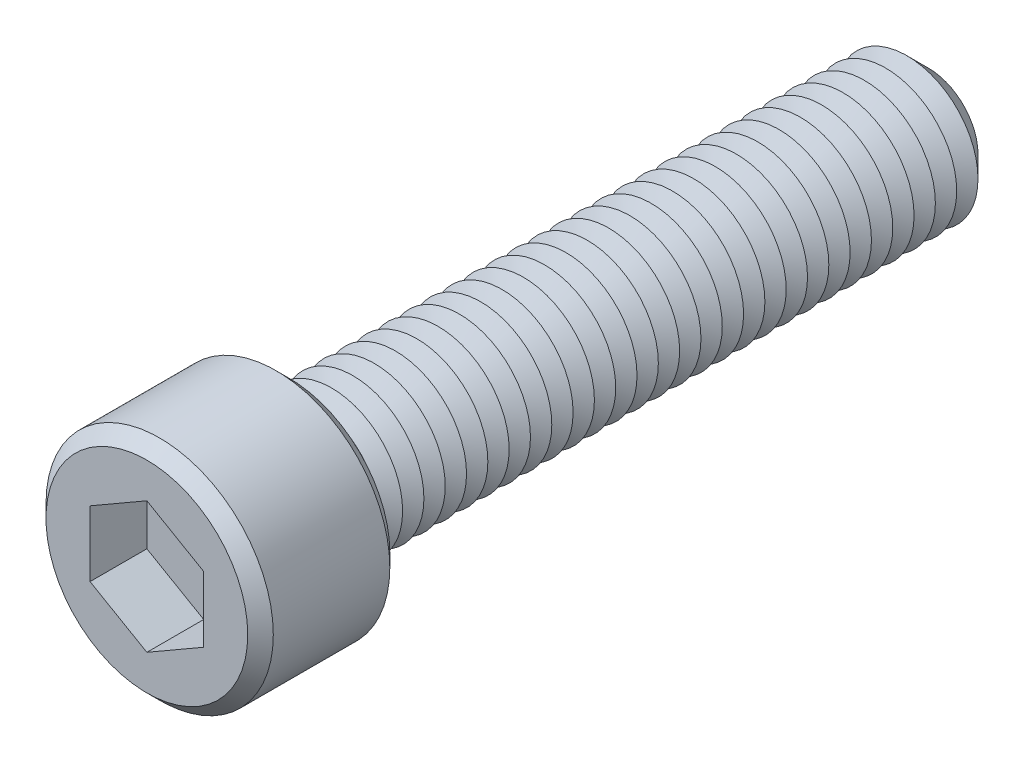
ISO-10303-21;
HEADER;
FILE_DESCRIPTION(('STEP AP214'),'2;1');
FILE_NAME('part.step','',(''),(''),'','','');
FILE_SCHEMA(('AUTOMOTIVE_DESIGN { 1 0 10303 214 1 1 1 1 }'));
ENDSEC;
DATA;
#1=APPLICATION_CONTEXT('core data for automotive mechanical design processes');
#2=APPLICATION_PROTOCOL_DEFINITION('international standard','automotive_design',2000,#1);
#3=PRODUCT_CONTEXT('',#1,'mechanical');
#4=PRODUCT('Part','Part','',(#3));
#5=PRODUCT_RELATED_PRODUCT_CATEGORY('part','',(#4));
#6=PRODUCT_DEFINITION_FORMATION('','',#4);
#7=PRODUCT_DEFINITION_CONTEXT('part definition',#1,'design');
#8=PRODUCT_DEFINITION('design','',#6,#7);
#9=PRODUCT_DEFINITION_SHAPE('','',#8);
#10=(LENGTH_UNIT() NAMED_UNIT(*) SI_UNIT(.MILLI.,.METRE.));
#11=(NAMED_UNIT(*) PLANE_ANGLE_UNIT() SI_UNIT($,.RADIAN.));
#12=(NAMED_UNIT(*) SI_UNIT($,.STERADIAN.) SOLID_ANGLE_UNIT());
#13=UNCERTAINTY_MEASURE_WITH_UNIT(LENGTH_MEASURE(1.E-05),#10,'distance_accuracy_value','');
#14=(GEOMETRIC_REPRESENTATION_CONTEXT(3) GLOBAL_UNCERTAINTY_ASSIGNED_CONTEXT((#13)) GLOBAL_UNIT_ASSIGNED_CONTEXT((#10,
#11,#12)) REPRESENTATION_CONTEXT('',''));
#15=CARTESIAN_POINT('',(0.,0.,0.));
#16=DIRECTION('',(0.,0.,1.));
#17=DIRECTION('',(1.,0.,0.));
#18=AXIS2_PLACEMENT_3D('',#15,#16,#17);
#19=CARTESIAN_POINT('',(0.,0.,10.));
#20=DIRECTION('',(0.,0.,-1.));
#21=DIRECTION('',(-1.,0.,0.));
#22=AXIS2_PLACEMENT_3D('',#19,#20,#21);
#23=CYLINDRICAL_SURFACE('',#22,8.);
#24=CARTESIAN_POINT('',(0.,0.,0.899999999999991));
#25=DIRECTION('',(0.,0.,1.));
#26=DIRECTION('',(1.,0.,0.));
#27=AXIS2_PLACEMENT_3D('',#24,#25,#26);
#28=CIRCLE('',#27,8.);
#29=CARTESIAN_POINT('',(8.,0.,0.899999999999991));
#30=VERTEX_POINT('',#29);
#31=EDGE_CURVE('E408',#30,#30,#28,.T.);
#32=ORIENTED_EDGE('',*,*,#31,.T.);
#33=EDGE_LOOP('',(#32));
#34=FACE_BOUND('',#33,.T.);
#35=CARTESIAN_POINT('',(0.,0.,9.09999999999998));
#36=DIRECTION('',(0.,0.,1.));
#37=DIRECTION('',(1.,0.,0.));
#38=AXIS2_PLACEMENT_3D('',#35,#36,#37);
#39=CIRCLE('',#38,8.);
#40=CARTESIAN_POINT('',(8.,0.,9.09999999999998));
#41=VERTEX_POINT('',#40);
#42=EDGE_CURVE('E404',#41,#41,#39,.F.);
#43=ORIENTED_EDGE('',*,*,#42,.T.);
#44=EDGE_LOOP('',(#43));
#45=FACE_BOUND('',#44,.T.);
#46=ADVANCED_FACE('F39',(#34,#45),#23,.T.);
#47=CARTESIAN_POINT('',(0.,0.,10.));
#48=DIRECTION('',(0.,0.,1.));
#49=DIRECTION('',(1.,0.,0.));
#50=AXIS2_PLACEMENT_3D('',#47,#48,#49);
#51=PLANE('',#50);
#52=CARTESIAN_POINT('',(0.,0.,10.));
#53=DIRECTION('',(0.,0.,1.));
#54=DIRECTION('',(1.,0.,0.));
#55=AXIS2_PLACEMENT_3D('',#52,#53,#54);
#56=CIRCLE('',#55,7.09999999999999);
#57=CARTESIAN_POINT('',(7.09999999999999,0.,10.));
#58=VERTEX_POINT('',#57);
#59=EDGE_CURVE('E11',#58,#58,#56,.T.);
#60=ORIENTED_EDGE('',*,*,#59,.T.);
#61=EDGE_LOOP('',(#60));
#62=FACE_BOUND('',#61,.T.);
#63=DIRECTION('',(-0.866025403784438,0.5,0.));
#64=VECTOR('',#63,1.);
#65=CARTESIAN_POINT('',(4.,2.3094010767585,10.));
#66=LINE('',#65,#64);
#67=CARTESIAN_POINT('',(4.,2.3094010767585,10.));
#68=VERTEX_POINT('',#67);
#69=CARTESIAN_POINT('',(0.,4.61880215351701,10.));
#70=VERTEX_POINT('',#69);
#71=EDGE_CURVE('E55',#68,#70,#66,.T.);
#72=ORIENTED_EDGE('',*,*,#71,.F.);
#73=DIRECTION('',(0.,1.,0.));
#74=VECTOR('',#73,1.);
#75=CARTESIAN_POINT('',(4.,-2.30940107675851,10.));
#76=LINE('',#75,#74);
#77=CARTESIAN_POINT('',(4.,-2.30940107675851,10.));
#78=VERTEX_POINT('',#77);
#79=EDGE_CURVE('E150',#78,#68,#76,.T.);
#80=ORIENTED_EDGE('',*,*,#79,.F.);
#81=DIRECTION('',(0.866025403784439,0.5,0.));
#82=VECTOR('',#81,1.);
#83=CARTESIAN_POINT('',(0.,-4.61880215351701,10.));
#84=LINE('',#83,#82);
#85=CARTESIAN_POINT('',(0.,-4.61880215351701,10.));
#86=VERTEX_POINT('',#85);
#87=EDGE_CURVE('E147',#86,#78,#84,.T.);
#88=ORIENTED_EDGE('',*,*,#87,.F.);
#89=DIRECTION('',(0.866025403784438,-0.5,0.));
#90=VECTOR('',#89,1.);
#91=CARTESIAN_POINT('',(-4.,-2.3094010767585,10.));
#92=LINE('',#91,#90);
#93=CARTESIAN_POINT('',(-4.,-2.3094010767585,10.));
#94=VERTEX_POINT('',#93);
#95=EDGE_CURVE('E103',#94,#86,#92,.T.);
#96=ORIENTED_EDGE('',*,*,#95,.F.);
#97=DIRECTION('',(0.,-1.,0.));
#98=VECTOR('',#97,1.);
#99=CARTESIAN_POINT('',(-4.,2.3094010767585,10.));
#100=LINE('',#99,#98);
#101=CARTESIAN_POINT('',(-4.,2.3094010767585,10.));
#102=VERTEX_POINT('',#101);
#103=EDGE_CURVE('E141',#102,#94,#100,.T.);
#104=ORIENTED_EDGE('',*,*,#103,.F.);
#105=DIRECTION('',(-0.866025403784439,-0.5,0.));
#106=VECTOR('',#105,1.);
#107=CARTESIAN_POINT('',(0.,4.61880215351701,10.));
#108=LINE('',#107,#106);
#109=EDGE_CURVE('E136',#70,#102,#108,.T.);
#110=ORIENTED_EDGE('',*,*,#109,.F.);
#111=EDGE_LOOP('',(#72,#80,#88,#96,#104,#110));
#112=FACE_BOUND('',#111,.T.);
#113=ADVANCED_FACE('F427',(#62,#112),#51,.T.);
#114=CARTESIAN_POINT('',(0.,0.,0.));
#115=DIRECTION('',(0.,0.,1.));
#116=DIRECTION('',(1.,0.,0.));
#117=AXIS2_PLACEMENT_3D('',#114,#115,#116);
#118=PLANE('',#117);
#119=CARTESIAN_POINT('',(0.,0.,0.));
#120=DIRECTION('',(0.,0.,1.));
#121=DIRECTION('',(1.,0.,0.));
#122=AXIS2_PLACEMENT_3D('',#119,#120,#121);
#123=CIRCLE('',#122,7.1);
#124=CARTESIAN_POINT('',(7.1,0.,0.));
#125=VERTEX_POINT('',#124);
#126=EDGE_CURVE('E48',#125,#125,#123,.F.);
#127=ORIENTED_EDGE('',*,*,#126,.T.);
#128=EDGE_LOOP('',(#127));
#129=FACE_BOUND('',#128,.T.);
#130=CARTESIAN_POINT('',(0.,0.,0.));
#131=DIRECTION('',(0.,0.,1.));
#132=DIRECTION('',(1.,0.,0.));
#133=AXIS2_PLACEMENT_3D('',#130,#131,#132);
#134=CIRCLE('',#133,5.);
#135=CARTESIAN_POINT('',(5.,0.,0.));
#136=VERTEX_POINT('',#135);
#137=EDGE_CURVE('E396',#136,#136,#134,.T.);
#138=ORIENTED_EDGE('',*,*,#137,.T.);
#139=EDGE_LOOP('',(#138));
#140=FACE_BOUND('',#139,.T.);
#141=ADVANCED_FACE('F416',(#129,#140),#118,.F.);
#142=CARTESIAN_POINT('',(0.,0.,0.));
#143=DIRECTION('',(0.,0.,1.));
#144=DIRECTION('',(1.,0.,0.));
#145=AXIS2_PLACEMENT_3D('',#142,#143,#144);
#146=CONICAL_SURFACE('',#145,5.,1.0471975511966);
#147=CARTESIAN_POINT('',(0.,0.,-0.75));
#148=DIRECTION('',(0.,0.,1.));
#149=DIRECTION('',(1.,0.,0.));
#150=AXIS2_PLACEMENT_3D('',#147,#148,#149);
#151=CIRCLE('',#150,3.70096189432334);
#152=CARTESIAN_POINT('',(3.70096189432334,0.,-0.75));
#153=VERTEX_POINT('',#152);
#154=EDGE_CURVE('E392',#153,#153,#151,.T.);
#155=ORIENTED_EDGE('',*,*,#154,.T.);
#156=EDGE_LOOP('',(#155));
#157=FACE_BOUND('',#156,.T.);
#158=ORIENTED_EDGE('',*,*,#137,.F.);
#159=EDGE_LOOP('',(#158));
#160=FACE_BOUND('',#159,.T.);
#161=ADVANCED_FACE('F708',(#157,#160),#146,.T.);
#162=CARTESIAN_POINT('',(0.,0.,-0.75));
#163=DIRECTION('',(0.,0.,-1.));
#164=DIRECTION('',(-1.,0.,0.));
#165=AXIS2_PLACEMENT_3D('',#162,#163,#164);
#166=CONICAL_SURFACE('',#165,3.70096189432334,1.0471975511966);
#167=CARTESIAN_POINT('',(0.,0.,-1.5));
#168=DIRECTION('',(0.,0.,1.));
#169=DIRECTION('',(1.,0.,0.));
#170=AXIS2_PLACEMENT_3D('',#167,#168,#169);
#171=CIRCLE('',#170,5.);
#172=CARTESIAN_POINT('',(5.,0.,-1.5));
#173=VERTEX_POINT('',#172);
#174=EDGE_CURVE('E388',#173,#173,#171,.T.);
#175=ORIENTED_EDGE('',*,*,#174,.T.);
#176=EDGE_LOOP('',(#175));
#177=FACE_BOUND('',#176,.T.);
#178=ORIENTED_EDGE('',*,*,#154,.F.);
#179=EDGE_LOOP('',(#178));
#180=FACE_BOUND('',#179,.T.);
#181=ADVANCED_FACE('F704',(#177,#180),#166,.T.);
#182=CARTESIAN_POINT('',(0.,0.,-1.5));
#183=DIRECTION('',(0.,0.,1.));
#184=DIRECTION('',(1.,0.,0.));
#185=AXIS2_PLACEMENT_3D('',#182,#183,#184);
#186=CONICAL_SURFACE('',#185,5.,1.0471975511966);
#187=CARTESIAN_POINT('',(0.,0.,-2.25));
#188=DIRECTION('',(0.,0.,1.));
#189=DIRECTION('',(1.,0.,0.));
#190=AXIS2_PLACEMENT_3D('',#187,#188,#189);
#191=CIRCLE('',#190,3.70096189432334);
#192=CARTESIAN_POINT('',(3.70096189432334,0.,-2.25));
#193=VERTEX_POINT('',#192);
#194=EDGE_CURVE('E384',#193,#193,#191,.T.);
#195=ORIENTED_EDGE('',*,*,#194,.T.);
#196=EDGE_LOOP('',(#195));
#197=FACE_BOUND('',#196,.T.);
#198=ORIENTED_EDGE('',*,*,#174,.F.);
#199=EDGE_LOOP('',(#198));
#200=FACE_BOUND('',#199,.T.);
#201=ADVANCED_FACE('F700',(#197,#200),#186,.T.);
#202=CARTESIAN_POINT('',(0.,0.,-2.25));
#203=DIRECTION('',(0.,0.,-1.));
#204=DIRECTION('',(-1.,0.,0.));
#205=AXIS2_PLACEMENT_3D('',#202,#203,#204);
#206=CONICAL_SURFACE('',#205,3.70096189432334,1.0471975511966);
#207=CARTESIAN_POINT('',(0.,0.,-3.));
#208=DIRECTION('',(0.,0.,1.));
#209=DIRECTION('',(1.,0.,0.));
#210=AXIS2_PLACEMENT_3D('',#207,#208,#209);
#211=CIRCLE('',#210,5.);
#212=CARTESIAN_POINT('',(5.,0.,-3.));
#213=VERTEX_POINT('',#212);
#214=EDGE_CURVE('E380',#213,#213,#211,.T.);
#215=ORIENTED_EDGE('',*,*,#214,.T.);
#216=EDGE_LOOP('',(#215));
#217=FACE_BOUND('',#216,.T.);
#218=ORIENTED_EDGE('',*,*,#194,.F.);
#219=EDGE_LOOP('',(#218));
#220=FACE_BOUND('',#219,.T.);
#221=ADVANCED_FACE('F696',(#217,#220),#206,.T.);
#222=CARTESIAN_POINT('',(0.,0.,-3.));
#223=DIRECTION('',(0.,0.,1.));
#224=DIRECTION('',(1.,0.,0.));
#225=AXIS2_PLACEMENT_3D('',#222,#223,#224);
#226=CONICAL_SURFACE('',#225,5.,1.0471975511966);
#227=CARTESIAN_POINT('',(0.,0.,-3.75));
#228=DIRECTION('',(0.,0.,1.));
#229=DIRECTION('',(1.,0.,0.));
#230=AXIS2_PLACEMENT_3D('',#227,#228,#229);
#231=CIRCLE('',#230,3.70096189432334);
#232=CARTESIAN_POINT('',(3.70096189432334,0.,-3.75));
#233=VERTEX_POINT('',#232);
#234=EDGE_CURVE('E376',#233,#233,#231,.T.);
#235=ORIENTED_EDGE('',*,*,#234,.T.);
#236=EDGE_LOOP('',(#235));
#237=FACE_BOUND('',#236,.T.);
#238=ORIENTED_EDGE('',*,*,#214,.F.);
#239=EDGE_LOOP('',(#238));
#240=FACE_BOUND('',#239,.T.);
#241=ADVANCED_FACE('F692',(#237,#240),#226,.T.);
#242=CARTESIAN_POINT('',(0.,0.,-3.75));
#243=DIRECTION('',(0.,0.,-1.));
#244=DIRECTION('',(-1.,0.,0.));
#245=AXIS2_PLACEMENT_3D('',#242,#243,#244);
#246=CONICAL_SURFACE('',#245,3.70096189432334,1.0471975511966);
#247=CARTESIAN_POINT('',(0.,0.,-4.5));
#248=DIRECTION('',(0.,0.,1.));
#249=DIRECTION('',(1.,0.,0.));
#250=AXIS2_PLACEMENT_3D('',#247,#248,#249);
#251=CIRCLE('',#250,5.);
#252=CARTESIAN_POINT('',(5.,0.,-4.5));
#253=VERTEX_POINT('',#252);
#254=EDGE_CURVE('E372',#253,#253,#251,.T.);
#255=ORIENTED_EDGE('',*,*,#254,.T.);
#256=EDGE_LOOP('',(#255));
#257=FACE_BOUND('',#256,.T.);
#258=ORIENTED_EDGE('',*,*,#234,.F.);
#259=EDGE_LOOP('',(#258));
#260=FACE_BOUND('',#259,.T.);
#261=ADVANCED_FACE('F688',(#257,#260),#246,.T.);
#262=CARTESIAN_POINT('',(0.,0.,-4.5));
#263=DIRECTION('',(0.,0.,1.));
#264=DIRECTION('',(1.,0.,0.));
#265=AXIS2_PLACEMENT_3D('',#262,#263,#264);
#266=CONICAL_SURFACE('',#265,5.,1.0471975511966);
#267=CARTESIAN_POINT('',(0.,0.,-5.25));
#268=DIRECTION('',(0.,0.,1.));
#269=DIRECTION('',(1.,0.,0.));
#270=AXIS2_PLACEMENT_3D('',#267,#268,#269);
#271=CIRCLE('',#270,3.70096189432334);
#272=CARTESIAN_POINT('',(3.70096189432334,0.,-5.25));
#273=VERTEX_POINT('',#272);
#274=EDGE_CURVE('E368',#273,#273,#271,.T.);
#275=ORIENTED_EDGE('',*,*,#274,.T.);
#276=EDGE_LOOP('',(#275));
#277=FACE_BOUND('',#276,.T.);
#278=ORIENTED_EDGE('',*,*,#254,.F.);
#279=EDGE_LOOP('',(#278));
#280=FACE_BOUND('',#279,.T.);
#281=ADVANCED_FACE('F684',(#277,#280),#266,.T.);
#282=CARTESIAN_POINT('',(0.,0.,-5.25));
#283=DIRECTION('',(0.,0.,-1.));
#284=DIRECTION('',(-1.,0.,0.));
#285=AXIS2_PLACEMENT_3D('',#282,#283,#284);
#286=CONICAL_SURFACE('',#285,3.70096189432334,1.0471975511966);
#287=CARTESIAN_POINT('',(0.,0.,-6.));
#288=DIRECTION('',(0.,0.,1.));
#289=DIRECTION('',(1.,0.,0.));
#290=AXIS2_PLACEMENT_3D('',#287,#288,#289);
#291=CIRCLE('',#290,5.);
#292=CARTESIAN_POINT('',(5.,0.,-6.));
#293=VERTEX_POINT('',#292);
#294=EDGE_CURVE('E364',#293,#293,#291,.T.);
#295=ORIENTED_EDGE('',*,*,#294,.T.);
#296=EDGE_LOOP('',(#295));
#297=FACE_BOUND('',#296,.T.);
#298=ORIENTED_EDGE('',*,*,#274,.F.);
#299=EDGE_LOOP('',(#298));
#300=FACE_BOUND('',#299,.T.);
#301=ADVANCED_FACE('F680',(#297,#300),#286,.T.);
#302=CARTESIAN_POINT('',(0.,0.,-6.));
#303=DIRECTION('',(0.,0.,1.));
#304=DIRECTION('',(1.,0.,0.));
#305=AXIS2_PLACEMENT_3D('',#302,#303,#304);
#306=CONICAL_SURFACE('',#305,5.,1.0471975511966);
#307=CARTESIAN_POINT('',(0.,0.,-6.75));
#308=DIRECTION('',(0.,0.,1.));
#309=DIRECTION('',(1.,0.,0.));
#310=AXIS2_PLACEMENT_3D('',#307,#308,#309);
#311=CIRCLE('',#310,3.70096189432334);
#312=CARTESIAN_POINT('',(3.70096189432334,0.,-6.75));
#313=VERTEX_POINT('',#312);
#314=EDGE_CURVE('E360',#313,#313,#311,.T.);
#315=ORIENTED_EDGE('',*,*,#314,.T.);
#316=EDGE_LOOP('',(#315));
#317=FACE_BOUND('',#316,.T.);
#318=ORIENTED_EDGE('',*,*,#294,.F.);
#319=EDGE_LOOP('',(#318));
#320=FACE_BOUND('',#319,.T.);
#321=ADVANCED_FACE('F676',(#317,#320),#306,.T.);
#322=CARTESIAN_POINT('',(0.,0.,-6.75));
#323=DIRECTION('',(0.,0.,-1.));
#324=DIRECTION('',(-1.,0.,0.));
#325=AXIS2_PLACEMENT_3D('',#322,#323,#324);
#326=CONICAL_SURFACE('',#325,3.70096189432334,1.0471975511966);
#327=CARTESIAN_POINT('',(0.,0.,-7.5));
#328=DIRECTION('',(0.,0.,1.));
#329=DIRECTION('',(1.,0.,0.));
#330=AXIS2_PLACEMENT_3D('',#327,#328,#329);
#331=CIRCLE('',#330,5.);
#332=CARTESIAN_POINT('',(5.,0.,-7.5));
#333=VERTEX_POINT('',#332);
#334=EDGE_CURVE('E356',#333,#333,#331,.T.);
#335=ORIENTED_EDGE('',*,*,#334,.T.);
#336=EDGE_LOOP('',(#335));
#337=FACE_BOUND('',#336,.T.);
#338=ORIENTED_EDGE('',*,*,#314,.F.);
#339=EDGE_LOOP('',(#338));
#340=FACE_BOUND('',#339,.T.);
#341=ADVANCED_FACE('F672',(#337,#340),#326,.T.);
#342=CARTESIAN_POINT('',(0.,0.,-7.5));
#343=DIRECTION('',(0.,0.,1.));
#344=DIRECTION('',(1.,0.,0.));
#345=AXIS2_PLACEMENT_3D('',#342,#343,#344);
#346=CONICAL_SURFACE('',#345,5.,1.0471975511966);
#347=CARTESIAN_POINT('',(0.,0.,-8.25));
#348=DIRECTION('',(0.,0.,1.));
#349=DIRECTION('',(1.,0.,0.));
#350=AXIS2_PLACEMENT_3D('',#347,#348,#349);
#351=CIRCLE('',#350,3.70096189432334);
#352=CARTESIAN_POINT('',(3.70096189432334,0.,-8.25));
#353=VERTEX_POINT('',#352);
#354=EDGE_CURVE('E352',#353,#353,#351,.T.);
#355=ORIENTED_EDGE('',*,*,#354,.T.);
#356=EDGE_LOOP('',(#355));
#357=FACE_BOUND('',#356,.T.);
#358=ORIENTED_EDGE('',*,*,#334,.F.);
#359=EDGE_LOOP('',(#358));
#360=FACE_BOUND('',#359,.T.);
#361=ADVANCED_FACE('F668',(#357,#360),#346,.T.);
#362=CARTESIAN_POINT('',(0.,0.,-8.25));
#363=DIRECTION('',(0.,0.,-1.));
#364=DIRECTION('',(-1.,0.,0.));
#365=AXIS2_PLACEMENT_3D('',#362,#363,#364);
#366=CONICAL_SURFACE('',#365,3.70096189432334,1.0471975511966);
#367=CARTESIAN_POINT('',(0.,0.,-9.));
#368=DIRECTION('',(0.,0.,1.));
#369=DIRECTION('',(1.,0.,0.));
#370=AXIS2_PLACEMENT_3D('',#367,#368,#369);
#371=CIRCLE('',#370,5.);
#372=CARTESIAN_POINT('',(5.,0.,-9.));
#373=VERTEX_POINT('',#372);
#374=EDGE_CURVE('E348',#373,#373,#371,.T.);
#375=ORIENTED_EDGE('',*,*,#374,.T.);
#376=EDGE_LOOP('',(#375));
#377=FACE_BOUND('',#376,.T.);
#378=ORIENTED_EDGE('',*,*,#354,.F.);
#379=EDGE_LOOP('',(#378));
#380=FACE_BOUND('',#379,.T.);
#381=ADVANCED_FACE('F664',(#377,#380),#366,.T.);
#382=CARTESIAN_POINT('',(0.,0.,-9.));
#383=DIRECTION('',(0.,0.,1.));
#384=DIRECTION('',(1.,0.,0.));
#385=AXIS2_PLACEMENT_3D('',#382,#383,#384);
#386=CONICAL_SURFACE('',#385,5.,1.0471975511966);
#387=CARTESIAN_POINT('',(0.,0.,-9.75));
#388=DIRECTION('',(0.,0.,1.));
#389=DIRECTION('',(1.,0.,0.));
#390=AXIS2_PLACEMENT_3D('',#387,#388,#389);
#391=CIRCLE('',#390,3.70096189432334);
#392=CARTESIAN_POINT('',(3.70096189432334,0.,-9.75));
#393=VERTEX_POINT('',#392);
#394=EDGE_CURVE('E344',#393,#393,#391,.T.);
#395=ORIENTED_EDGE('',*,*,#394,.T.);
#396=EDGE_LOOP('',(#395));
#397=FACE_BOUND('',#396,.T.);
#398=ORIENTED_EDGE('',*,*,#374,.F.);
#399=EDGE_LOOP('',(#398));
#400=FACE_BOUND('',#399,.T.);
#401=ADVANCED_FACE('F660',(#397,#400),#386,.T.);
#402=CARTESIAN_POINT('',(0.,0.,-9.75));
#403=DIRECTION('',(0.,0.,-1.));
#404=DIRECTION('',(-1.,0.,0.));
#405=AXIS2_PLACEMENT_3D('',#402,#403,#404);
#406=CONICAL_SURFACE('',#405,3.70096189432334,1.0471975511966);
#407=CARTESIAN_POINT('',(0.,0.,-10.5));
#408=DIRECTION('',(0.,0.,1.));
#409=DIRECTION('',(1.,0.,0.));
#410=AXIS2_PLACEMENT_3D('',#407,#408,#409);
#411=CIRCLE('',#410,5.);
#412=CARTESIAN_POINT('',(5.,0.,-10.5));
#413=VERTEX_POINT('',#412);
#414=EDGE_CURVE('E340',#413,#413,#411,.T.);
#415=ORIENTED_EDGE('',*,*,#414,.T.);
#416=EDGE_LOOP('',(#415));
#417=FACE_BOUND('',#416,.T.);
#418=ORIENTED_EDGE('',*,*,#394,.F.);
#419=EDGE_LOOP('',(#418));
#420=FACE_BOUND('',#419,.T.);
#421=ADVANCED_FACE('F656',(#417,#420),#406,.T.);
#422=CARTESIAN_POINT('',(0.,0.,-10.5));
#423=DIRECTION('',(0.,0.,1.));
#424=DIRECTION('',(1.,0.,0.));
#425=AXIS2_PLACEMENT_3D('',#422,#423,#424);
#426=CONICAL_SURFACE('',#425,5.,1.0471975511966);
#427=CARTESIAN_POINT('',(0.,0.,-11.25));
#428=DIRECTION('',(0.,0.,1.));
#429=DIRECTION('',(1.,0.,0.));
#430=AXIS2_PLACEMENT_3D('',#427,#428,#429);
#431=CIRCLE('',#430,3.70096189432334);
#432=CARTESIAN_POINT('',(3.70096189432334,0.,-11.25));
#433=VERTEX_POINT('',#432);
#434=EDGE_CURVE('E336',#433,#433,#431,.T.);
#435=ORIENTED_EDGE('',*,*,#434,.T.);
#436=EDGE_LOOP('',(#435));
#437=FACE_BOUND('',#436,.T.);
#438=ORIENTED_EDGE('',*,*,#414,.F.);
#439=EDGE_LOOP('',(#438));
#440=FACE_BOUND('',#439,.T.);
#441=ADVANCED_FACE('F652',(#437,#440),#426,.T.);
#442=CARTESIAN_POINT('',(0.,0.,-11.25));
#443=DIRECTION('',(0.,0.,-1.));
#444=DIRECTION('',(-1.,0.,0.));
#445=AXIS2_PLACEMENT_3D('',#442,#443,#444);
#446=CONICAL_SURFACE('',#445,3.70096189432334,1.0471975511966);
#447=CARTESIAN_POINT('',(0.,0.,-12.));
#448=DIRECTION('',(0.,0.,1.));
#449=DIRECTION('',(1.,0.,0.));
#450=AXIS2_PLACEMENT_3D('',#447,#448,#449);
#451=CIRCLE('',#450,5.);
#452=CARTESIAN_POINT('',(5.,0.,-12.));
#453=VERTEX_POINT('',#452);
#454=EDGE_CURVE('E332',#453,#453,#451,.T.);
#455=ORIENTED_EDGE('',*,*,#454,.T.);
#456=EDGE_LOOP('',(#455));
#457=FACE_BOUND('',#456,.T.);
#458=ORIENTED_EDGE('',*,*,#434,.F.);
#459=EDGE_LOOP('',(#458));
#460=FACE_BOUND('',#459,.T.);
#461=ADVANCED_FACE('F648',(#457,#460),#446,.T.);
#462=CARTESIAN_POINT('',(0.,0.,-12.));
#463=DIRECTION('',(0.,0.,1.));
#464=DIRECTION('',(1.,0.,0.));
#465=AXIS2_PLACEMENT_3D('',#462,#463,#464);
#466=CONICAL_SURFACE('',#465,5.,1.0471975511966);
#467=CARTESIAN_POINT('',(0.,0.,-12.75));
#468=DIRECTION('',(0.,0.,1.));
#469=DIRECTION('',(1.,0.,0.));
#470=AXIS2_PLACEMENT_3D('',#467,#468,#469);
#471=CIRCLE('',#470,3.70096189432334);
#472=CARTESIAN_POINT('',(3.70096189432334,0.,-12.75));
#473=VERTEX_POINT('',#472);
#474=EDGE_CURVE('E328',#473,#473,#471,.T.);
#475=ORIENTED_EDGE('',*,*,#474,.T.);
#476=EDGE_LOOP('',(#475));
#477=FACE_BOUND('',#476,.T.);
#478=ORIENTED_EDGE('',*,*,#454,.F.);
#479=EDGE_LOOP('',(#478));
#480=FACE_BOUND('',#479,.T.);
#481=ADVANCED_FACE('F644',(#477,#480),#466,.T.);
#482=CARTESIAN_POINT('',(0.,0.,-12.75));
#483=DIRECTION('',(0.,0.,-1.));
#484=DIRECTION('',(-1.,0.,0.));
#485=AXIS2_PLACEMENT_3D('',#482,#483,#484);
#486=CONICAL_SURFACE('',#485,3.70096189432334,1.0471975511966);
#487=CARTESIAN_POINT('',(0.,0.,-13.5));
#488=DIRECTION('',(0.,0.,1.));
#489=DIRECTION('',(1.,0.,0.));
#490=AXIS2_PLACEMENT_3D('',#487,#488,#489);
#491=CIRCLE('',#490,5.);
#492=CARTESIAN_POINT('',(5.,0.,-13.5));
#493=VERTEX_POINT('',#492);
#494=EDGE_CURVE('E324',#493,#493,#491,.T.);
#495=ORIENTED_EDGE('',*,*,#494,.T.);
#496=EDGE_LOOP('',(#495));
#497=FACE_BOUND('',#496,.T.);
#498=ORIENTED_EDGE('',*,*,#474,.F.);
#499=EDGE_LOOP('',(#498));
#500=FACE_BOUND('',#499,.T.);
#501=ADVANCED_FACE('F640',(#497,#500),#486,.T.);
#502=CARTESIAN_POINT('',(0.,0.,-13.5));
#503=DIRECTION('',(0.,0.,1.));
#504=DIRECTION('',(1.,0.,0.));
#505=AXIS2_PLACEMENT_3D('',#502,#503,#504);
#506=CONICAL_SURFACE('',#505,5.,1.0471975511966);
#507=CARTESIAN_POINT('',(0.,0.,-14.25));
#508=DIRECTION('',(0.,0.,1.));
#509=DIRECTION('',(1.,0.,0.));
#510=AXIS2_PLACEMENT_3D('',#507,#508,#509);
#511=CIRCLE('',#510,3.70096189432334);
#512=CARTESIAN_POINT('',(3.70096189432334,0.,-14.25));
#513=VERTEX_POINT('',#512);
#514=EDGE_CURVE('E320',#513,#513,#511,.T.);
#515=ORIENTED_EDGE('',*,*,#514,.T.);
#516=EDGE_LOOP('',(#515));
#517=FACE_BOUND('',#516,.T.);
#518=ORIENTED_EDGE('',*,*,#494,.F.);
#519=EDGE_LOOP('',(#518));
#520=FACE_BOUND('',#519,.T.);
#521=ADVANCED_FACE('F636',(#517,#520),#506,.T.);
#522=CARTESIAN_POINT('',(0.,0.,-14.25));
#523=DIRECTION('',(0.,0.,-1.));
#524=DIRECTION('',(-1.,0.,0.));
#525=AXIS2_PLACEMENT_3D('',#522,#523,#524);
#526=CONICAL_SURFACE('',#525,3.70096189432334,1.0471975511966);
#527=CARTESIAN_POINT('',(0.,0.,-15.));
#528=DIRECTION('',(0.,0.,1.));
#529=DIRECTION('',(1.,0.,0.));
#530=AXIS2_PLACEMENT_3D('',#527,#528,#529);
#531=CIRCLE('',#530,5.);
#532=CARTESIAN_POINT('',(5.,0.,-15.));
#533=VERTEX_POINT('',#532);
#534=EDGE_CURVE('E316',#533,#533,#531,.T.);
#535=ORIENTED_EDGE('',*,*,#534,.T.);
#536=EDGE_LOOP('',(#535));
#537=FACE_BOUND('',#536,.T.);
#538=ORIENTED_EDGE('',*,*,#514,.F.);
#539=EDGE_LOOP('',(#538));
#540=FACE_BOUND('',#539,.T.);
#541=ADVANCED_FACE('F632',(#537,#540),#526,.T.);
#542=CARTESIAN_POINT('',(0.,0.,-15.));
#543=DIRECTION('',(0.,0.,1.));
#544=DIRECTION('',(1.,0.,0.));
#545=AXIS2_PLACEMENT_3D('',#542,#543,#544);
#546=CONICAL_SURFACE('',#545,5.,1.0471975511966);
#547=CARTESIAN_POINT('',(0.,0.,-15.75));
#548=DIRECTION('',(0.,0.,1.));
#549=DIRECTION('',(1.,0.,0.));
#550=AXIS2_PLACEMENT_3D('',#547,#548,#549);
#551=CIRCLE('',#550,3.70096189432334);
#552=CARTESIAN_POINT('',(3.70096189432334,0.,-15.75));
#553=VERTEX_POINT('',#552);
#554=EDGE_CURVE('E312',#553,#553,#551,.T.);
#555=ORIENTED_EDGE('',*,*,#554,.T.);
#556=EDGE_LOOP('',(#555));
#557=FACE_BOUND('',#556,.T.);
#558=ORIENTED_EDGE('',*,*,#534,.F.);
#559=EDGE_LOOP('',(#558));
#560=FACE_BOUND('',#559,.T.);
#561=ADVANCED_FACE('F628',(#557,#560),#546,.T.);
#562=CARTESIAN_POINT('',(0.,0.,-15.75));
#563=DIRECTION('',(0.,0.,-1.));
#564=DIRECTION('',(-1.,0.,0.));
#565=AXIS2_PLACEMENT_3D('',#562,#563,#564);
#566=CONICAL_SURFACE('',#565,3.70096189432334,1.0471975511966);
#567=CARTESIAN_POINT('',(0.,0.,-16.5));
#568=DIRECTION('',(0.,0.,1.));
#569=DIRECTION('',(1.,0.,0.));
#570=AXIS2_PLACEMENT_3D('',#567,#568,#569);
#571=CIRCLE('',#570,5.);
#572=CARTESIAN_POINT('',(5.,0.,-16.5));
#573=VERTEX_POINT('',#572);
#574=EDGE_CURVE('E308',#573,#573,#571,.T.);
#575=ORIENTED_EDGE('',*,*,#574,.T.);
#576=EDGE_LOOP('',(#575));
#577=FACE_BOUND('',#576,.T.);
#578=ORIENTED_EDGE('',*,*,#554,.F.);
#579=EDGE_LOOP('',(#578));
#580=FACE_BOUND('',#579,.T.);
#581=ADVANCED_FACE('F624',(#577,#580),#566,.T.);
#582=CARTESIAN_POINT('',(0.,0.,-16.5));
#583=DIRECTION('',(0.,0.,1.));
#584=DIRECTION('',(1.,0.,0.));
#585=AXIS2_PLACEMENT_3D('',#582,#583,#584);
#586=CONICAL_SURFACE('',#585,5.,1.0471975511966);
#587=CARTESIAN_POINT('',(0.,0.,-17.25));
#588=DIRECTION('',(0.,0.,1.));
#589=DIRECTION('',(1.,0.,0.));
#590=AXIS2_PLACEMENT_3D('',#587,#588,#589);
#591=CIRCLE('',#590,3.70096189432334);
#592=CARTESIAN_POINT('',(3.70096189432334,0.,-17.25));
#593=VERTEX_POINT('',#592);
#594=EDGE_CURVE('E304',#593,#593,#591,.T.);
#595=ORIENTED_EDGE('',*,*,#594,.T.);
#596=EDGE_LOOP('',(#595));
#597=FACE_BOUND('',#596,.T.);
#598=ORIENTED_EDGE('',*,*,#574,.F.);
#599=EDGE_LOOP('',(#598));
#600=FACE_BOUND('',#599,.T.);
#601=ADVANCED_FACE('F620',(#597,#600),#586,.T.);
#602=CARTESIAN_POINT('',(0.,0.,-17.25));
#603=DIRECTION('',(0.,0.,-1.));
#604=DIRECTION('',(-1.,0.,0.));
#605=AXIS2_PLACEMENT_3D('',#602,#603,#604);
#606=CONICAL_SURFACE('',#605,3.70096189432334,1.0471975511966);
#607=CARTESIAN_POINT('',(0.,0.,-18.));
#608=DIRECTION('',(0.,0.,1.));
#609=DIRECTION('',(1.,0.,0.));
#610=AXIS2_PLACEMENT_3D('',#607,#608,#609);
#611=CIRCLE('',#610,5.);
#612=CARTESIAN_POINT('',(5.,0.,-18.));
#613=VERTEX_POINT('',#612);
#614=EDGE_CURVE('E300',#613,#613,#611,.T.);
#615=ORIENTED_EDGE('',*,*,#614,.T.);
#616=EDGE_LOOP('',(#615));
#617=FACE_BOUND('',#616,.T.);
#618=ORIENTED_EDGE('',*,*,#594,.F.);
#619=EDGE_LOOP('',(#618));
#620=FACE_BOUND('',#619,.T.);
#621=ADVANCED_FACE('F616',(#617,#620),#606,.T.);
#622=CARTESIAN_POINT('',(0.,0.,-18.));
#623=DIRECTION('',(0.,0.,1.));
#624=DIRECTION('',(1.,0.,0.));
#625=AXIS2_PLACEMENT_3D('',#622,#623,#624);
#626=CONICAL_SURFACE('',#625,5.,1.0471975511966);
#627=CARTESIAN_POINT('',(0.,0.,-18.75));
#628=DIRECTION('',(0.,0.,1.));
#629=DIRECTION('',(1.,0.,0.));
#630=AXIS2_PLACEMENT_3D('',#627,#628,#629);
#631=CIRCLE('',#630,3.70096189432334);
#632=CARTESIAN_POINT('',(3.70096189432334,0.,-18.75));
#633=VERTEX_POINT('',#632);
#634=EDGE_CURVE('E296',#633,#633,#631,.T.);
#635=ORIENTED_EDGE('',*,*,#634,.T.);
#636=EDGE_LOOP('',(#635));
#637=FACE_BOUND('',#636,.T.);
#638=ORIENTED_EDGE('',*,*,#614,.F.);
#639=EDGE_LOOP('',(#638));
#640=FACE_BOUND('',#639,.T.);
#641=ADVANCED_FACE('F612',(#637,#640),#626,.T.);
#642=CARTESIAN_POINT('',(0.,0.,-18.75));
#643=DIRECTION('',(0.,0.,-1.));
#644=DIRECTION('',(-1.,0.,0.));
#645=AXIS2_PLACEMENT_3D('',#642,#643,#644);
#646=CONICAL_SURFACE('',#645,3.70096189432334,1.0471975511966);
#647=CARTESIAN_POINT('',(0.,0.,-19.5));
#648=DIRECTION('',(0.,0.,1.));
#649=DIRECTION('',(1.,0.,0.));
#650=AXIS2_PLACEMENT_3D('',#647,#648,#649);
#651=CIRCLE('',#650,5.);
#652=CARTESIAN_POINT('',(5.,0.,-19.5));
#653=VERTEX_POINT('',#652);
#654=EDGE_CURVE('E292',#653,#653,#651,.T.);
#655=ORIENTED_EDGE('',*,*,#654,.T.);
#656=EDGE_LOOP('',(#655));
#657=FACE_BOUND('',#656,.T.);
#658=ORIENTED_EDGE('',*,*,#634,.F.);
#659=EDGE_LOOP('',(#658));
#660=FACE_BOUND('',#659,.T.);
#661=ADVANCED_FACE('F608',(#657,#660),#646,.T.);
#662=CARTESIAN_POINT('',(0.,0.,-19.5));
#663=DIRECTION('',(0.,0.,1.));
#664=DIRECTION('',(1.,0.,0.));
#665=AXIS2_PLACEMENT_3D('',#662,#663,#664);
#666=CONICAL_SURFACE('',#665,5.,1.0471975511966);
#667=CARTESIAN_POINT('',(0.,0.,-20.25));
#668=DIRECTION('',(0.,0.,1.));
#669=DIRECTION('',(1.,0.,0.));
#670=AXIS2_PLACEMENT_3D('',#667,#668,#669);
#671=CIRCLE('',#670,3.70096189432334);
#672=CARTESIAN_POINT('',(3.70096189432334,0.,-20.25));
#673=VERTEX_POINT('',#672);
#674=EDGE_CURVE('E288',#673,#673,#671,.T.);
#675=ORIENTED_EDGE('',*,*,#674,.T.);
#676=EDGE_LOOP('',(#675));
#677=FACE_BOUND('',#676,.T.);
#678=ORIENTED_EDGE('',*,*,#654,.F.);
#679=EDGE_LOOP('',(#678));
#680=FACE_BOUND('',#679,.T.);
#681=ADVANCED_FACE('F604',(#677,#680),#666,.T.);
#682=CARTESIAN_POINT('',(0.,0.,-20.25));
#683=DIRECTION('',(0.,0.,-1.));
#684=DIRECTION('',(-1.,0.,0.));
#685=AXIS2_PLACEMENT_3D('',#682,#683,#684);
#686=CONICAL_SURFACE('',#685,3.70096189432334,1.0471975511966);
#687=CARTESIAN_POINT('',(0.,0.,-21.));
#688=DIRECTION('',(0.,0.,1.));
#689=DIRECTION('',(1.,0.,0.));
#690=AXIS2_PLACEMENT_3D('',#687,#688,#689);
#691=CIRCLE('',#690,5.);
#692=CARTESIAN_POINT('',(5.,0.,-21.));
#693=VERTEX_POINT('',#692);
#694=EDGE_CURVE('E284',#693,#693,#691,.T.);
#695=ORIENTED_EDGE('',*,*,#694,.T.);
#696=EDGE_LOOP('',(#695));
#697=FACE_BOUND('',#696,.T.);
#698=ORIENTED_EDGE('',*,*,#674,.F.);
#699=EDGE_LOOP('',(#698));
#700=FACE_BOUND('',#699,.T.);
#701=ADVANCED_FACE('F600',(#697,#700),#686,.T.);
#702=CARTESIAN_POINT('',(0.,0.,-21.));
#703=DIRECTION('',(0.,0.,1.));
#704=DIRECTION('',(1.,0.,0.));
#705=AXIS2_PLACEMENT_3D('',#702,#703,#704);
#706=CONICAL_SURFACE('',#705,5.,1.0471975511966);
#707=CARTESIAN_POINT('',(0.,0.,-21.75));
#708=DIRECTION('',(0.,0.,1.));
#709=DIRECTION('',(1.,0.,0.));
#710=AXIS2_PLACEMENT_3D('',#707,#708,#709);
#711=CIRCLE('',#710,3.70096189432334);
#712=CARTESIAN_POINT('',(3.70096189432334,0.,-21.75));
#713=VERTEX_POINT('',#712);
#714=EDGE_CURVE('E280',#713,#713,#711,.T.);
#715=ORIENTED_EDGE('',*,*,#714,.T.);
#716=EDGE_LOOP('',(#715));
#717=FACE_BOUND('',#716,.T.);
#718=ORIENTED_EDGE('',*,*,#694,.F.);
#719=EDGE_LOOP('',(#718));
#720=FACE_BOUND('',#719,.T.);
#721=ADVANCED_FACE('F596',(#717,#720),#706,.T.);
#722=CARTESIAN_POINT('',(0.,0.,-21.75));
#723=DIRECTION('',(0.,0.,-1.));
#724=DIRECTION('',(-1.,0.,0.));
#725=AXIS2_PLACEMENT_3D('',#722,#723,#724);
#726=CONICAL_SURFACE('',#725,3.70096189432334,1.0471975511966);
#727=CARTESIAN_POINT('',(0.,0.,-22.5));
#728=DIRECTION('',(0.,0.,1.));
#729=DIRECTION('',(1.,0.,0.));
#730=AXIS2_PLACEMENT_3D('',#727,#728,#729);
#731=CIRCLE('',#730,5.);
#732=CARTESIAN_POINT('',(5.,0.,-22.5));
#733=VERTEX_POINT('',#732);
#734=EDGE_CURVE('E276',#733,#733,#731,.T.);
#735=ORIENTED_EDGE('',*,*,#734,.T.);
#736=EDGE_LOOP('',(#735));
#737=FACE_BOUND('',#736,.T.);
#738=ORIENTED_EDGE('',*,*,#714,.F.);
#739=EDGE_LOOP('',(#738));
#740=FACE_BOUND('',#739,.T.);
#741=ADVANCED_FACE('F592',(#737,#740),#726,.T.);
#742=CARTESIAN_POINT('',(0.,0.,-22.5));
#743=DIRECTION('',(0.,0.,1.));
#744=DIRECTION('',(1.,0.,0.));
#745=AXIS2_PLACEMENT_3D('',#742,#743,#744);
#746=CONICAL_SURFACE('',#745,5.,1.0471975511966);
#747=CARTESIAN_POINT('',(0.,0.,-23.25));
#748=DIRECTION('',(0.,0.,1.));
#749=DIRECTION('',(1.,0.,0.));
#750=AXIS2_PLACEMENT_3D('',#747,#748,#749);
#751=CIRCLE('',#750,3.70096189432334);
#752=CARTESIAN_POINT('',(3.70096189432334,0.,-23.25));
#753=VERTEX_POINT('',#752);
#754=EDGE_CURVE('E272',#753,#753,#751,.T.);
#755=ORIENTED_EDGE('',*,*,#754,.T.);
#756=EDGE_LOOP('',(#755));
#757=FACE_BOUND('',#756,.T.);
#758=ORIENTED_EDGE('',*,*,#734,.F.);
#759=EDGE_LOOP('',(#758));
#760=FACE_BOUND('',#759,.T.);
#761=ADVANCED_FACE('F588',(#757,#760),#746,.T.);
#762=CARTESIAN_POINT('',(0.,0.,-23.25));
#763=DIRECTION('',(0.,0.,-1.));
#764=DIRECTION('',(-1.,0.,0.));
#765=AXIS2_PLACEMENT_3D('',#762,#763,#764);
#766=CONICAL_SURFACE('',#765,3.70096189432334,1.0471975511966);
#767=CARTESIAN_POINT('',(0.,0.,-24.));
#768=DIRECTION('',(0.,0.,1.));
#769=DIRECTION('',(1.,0.,0.));
#770=AXIS2_PLACEMENT_3D('',#767,#768,#769);
#771=CIRCLE('',#770,5.);
#772=CARTESIAN_POINT('',(5.,0.,-24.));
#773=VERTEX_POINT('',#772);
#774=EDGE_CURVE('E268',#773,#773,#771,.T.);
#775=ORIENTED_EDGE('',*,*,#774,.T.);
#776=EDGE_LOOP('',(#775));
#777=FACE_BOUND('',#776,.T.);
#778=ORIENTED_EDGE('',*,*,#754,.F.);
#779=EDGE_LOOP('',(#778));
#780=FACE_BOUND('',#779,.T.);
#781=ADVANCED_FACE('F584',(#777,#780),#766,.T.);
#782=CARTESIAN_POINT('',(0.,0.,-24.));
#783=DIRECTION('',(0.,0.,1.));
#784=DIRECTION('',(1.,0.,0.));
#785=AXIS2_PLACEMENT_3D('',#782,#783,#784);
#786=CONICAL_SURFACE('',#785,5.,1.0471975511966);
#787=CARTESIAN_POINT('',(0.,0.,-24.75));
#788=DIRECTION('',(0.,0.,1.));
#789=DIRECTION('',(1.,0.,0.));
#790=AXIS2_PLACEMENT_3D('',#787,#788,#789);
#791=CIRCLE('',#790,3.70096189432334);
#792=CARTESIAN_POINT('',(3.70096189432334,0.,-24.75));
#793=VERTEX_POINT('',#792);
#794=EDGE_CURVE('E264',#793,#793,#791,.T.);
#795=ORIENTED_EDGE('',*,*,#794,.T.);
#796=EDGE_LOOP('',(#795));
#797=FACE_BOUND('',#796,.T.);
#798=ORIENTED_EDGE('',*,*,#774,.F.);
#799=EDGE_LOOP('',(#798));
#800=FACE_BOUND('',#799,.T.);
#801=ADVANCED_FACE('F580',(#797,#800),#786,.T.);
#802=CARTESIAN_POINT('',(0.,0.,-24.75));
#803=DIRECTION('',(0.,0.,-1.));
#804=DIRECTION('',(-1.,0.,0.));
#805=AXIS2_PLACEMENT_3D('',#802,#803,#804);
#806=CONICAL_SURFACE('',#805,3.70096189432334,1.0471975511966);
#807=CARTESIAN_POINT('',(0.,0.,-25.5));
#808=DIRECTION('',(0.,0.,1.));
#809=DIRECTION('',(1.,0.,0.));
#810=AXIS2_PLACEMENT_3D('',#807,#808,#809);
#811=CIRCLE('',#810,5.);
#812=CARTESIAN_POINT('',(5.,0.,-25.5));
#813=VERTEX_POINT('',#812);
#814=EDGE_CURVE('E260',#813,#813,#811,.T.);
#815=ORIENTED_EDGE('',*,*,#814,.T.);
#816=EDGE_LOOP('',(#815));
#817=FACE_BOUND('',#816,.T.);
#818=ORIENTED_EDGE('',*,*,#794,.F.);
#819=EDGE_LOOP('',(#818));
#820=FACE_BOUND('',#819,.T.);
#821=ADVANCED_FACE('F576',(#817,#820),#806,.T.);
#822=CARTESIAN_POINT('',(0.,0.,-25.5));
#823=DIRECTION('',(0.,0.,1.));
#824=DIRECTION('',(1.,0.,0.));
#825=AXIS2_PLACEMENT_3D('',#822,#823,#824);
#826=CONICAL_SURFACE('',#825,5.,1.0471975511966);
#827=CARTESIAN_POINT('',(0.,0.,-26.25));
#828=DIRECTION('',(0.,0.,1.));
#829=DIRECTION('',(1.,0.,0.));
#830=AXIS2_PLACEMENT_3D('',#827,#828,#829);
#831=CIRCLE('',#830,3.70096189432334);
#832=CARTESIAN_POINT('',(3.70096189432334,0.,-26.25));
#833=VERTEX_POINT('',#832);
#834=EDGE_CURVE('E256',#833,#833,#831,.T.);
#835=ORIENTED_EDGE('',*,*,#834,.T.);
#836=EDGE_LOOP('',(#835));
#837=FACE_BOUND('',#836,.T.);
#838=ORIENTED_EDGE('',*,*,#814,.F.);
#839=EDGE_LOOP('',(#838));
#840=FACE_BOUND('',#839,.T.);
#841=ADVANCED_FACE('F572',(#837,#840),#826,.T.);
#842=CARTESIAN_POINT('',(0.,0.,-26.25));
#843=DIRECTION('',(0.,0.,-1.));
#844=DIRECTION('',(-1.,0.,0.));
#845=AXIS2_PLACEMENT_3D('',#842,#843,#844);
#846=CONICAL_SURFACE('',#845,3.70096189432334,1.0471975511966);
#847=CARTESIAN_POINT('',(0.,0.,-27.));
#848=DIRECTION('',(0.,0.,1.));
#849=DIRECTION('',(1.,0.,0.));
#850=AXIS2_PLACEMENT_3D('',#847,#848,#849);
#851=CIRCLE('',#850,5.);
#852=CARTESIAN_POINT('',(5.,0.,-27.));
#853=VERTEX_POINT('',#852);
#854=EDGE_CURVE('E252',#853,#853,#851,.T.);
#855=ORIENTED_EDGE('',*,*,#854,.T.);
#856=EDGE_LOOP('',(#855));
#857=FACE_BOUND('',#856,.T.);
#858=ORIENTED_EDGE('',*,*,#834,.F.);
#859=EDGE_LOOP('',(#858));
#860=FACE_BOUND('',#859,.T.);
#861=ADVANCED_FACE('F568',(#857,#860),#846,.T.);
#862=CARTESIAN_POINT('',(0.,0.,-27.));
#863=DIRECTION('',(0.,0.,1.));
#864=DIRECTION('',(1.,0.,0.));
#865=AXIS2_PLACEMENT_3D('',#862,#863,#864);
#866=CONICAL_SURFACE('',#865,5.,1.0471975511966);
#867=CARTESIAN_POINT('',(0.,0.,-27.75));
#868=DIRECTION('',(0.,0.,1.));
#869=DIRECTION('',(1.,0.,0.));
#870=AXIS2_PLACEMENT_3D('',#867,#868,#869);
#871=CIRCLE('',#870,3.70096189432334);
#872=CARTESIAN_POINT('',(3.70096189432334,0.,-27.75));
#873=VERTEX_POINT('',#872);
#874=EDGE_CURVE('E248',#873,#873,#871,.T.);
#875=ORIENTED_EDGE('',*,*,#874,.T.);
#876=EDGE_LOOP('',(#875));
#877=FACE_BOUND('',#876,.T.);
#878=ORIENTED_EDGE('',*,*,#854,.F.);
#879=EDGE_LOOP('',(#878));
#880=FACE_BOUND('',#879,.T.);
#881=ADVANCED_FACE('F564',(#877,#880),#866,.T.);
#882=CARTESIAN_POINT('',(0.,0.,-27.75));
#883=DIRECTION('',(0.,0.,-1.));
#884=DIRECTION('',(-1.,0.,0.));
#885=AXIS2_PLACEMENT_3D('',#882,#883,#884);
#886=CONICAL_SURFACE('',#885,3.70096189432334,1.0471975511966);
#887=CARTESIAN_POINT('',(0.,0.,-28.5));
#888=DIRECTION('',(0.,0.,1.));
#889=DIRECTION('',(1.,0.,0.));
#890=AXIS2_PLACEMENT_3D('',#887,#888,#889);
#891=CIRCLE('',#890,5.);
#892=CARTESIAN_POINT('',(5.,0.,-28.5));
#893=VERTEX_POINT('',#892);
#894=EDGE_CURVE('E244',#893,#893,#891,.T.);
#895=ORIENTED_EDGE('',*,*,#894,.T.);
#896=EDGE_LOOP('',(#895));
#897=FACE_BOUND('',#896,.T.);
#898=ORIENTED_EDGE('',*,*,#874,.F.);
#899=EDGE_LOOP('',(#898));
#900=FACE_BOUND('',#899,.T.);
#901=ADVANCED_FACE('F560',(#897,#900),#886,.T.);
#902=CARTESIAN_POINT('',(0.,0.,-28.5));
#903=DIRECTION('',(0.,0.,1.));
#904=DIRECTION('',(1.,0.,0.));
#905=AXIS2_PLACEMENT_3D('',#902,#903,#904);
#906=CONICAL_SURFACE('',#905,5.,1.0471975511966);
#907=CARTESIAN_POINT('',(0.,0.,-29.25));
#908=DIRECTION('',(0.,0.,1.));
#909=DIRECTION('',(1.,0.,0.));
#910=AXIS2_PLACEMENT_3D('',#907,#908,#909);
#911=CIRCLE('',#910,3.70096189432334);
#912=CARTESIAN_POINT('',(3.70096189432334,0.,-29.25));
#913=VERTEX_POINT('',#912);
#914=EDGE_CURVE('E240',#913,#913,#911,.T.);
#915=ORIENTED_EDGE('',*,*,#914,.T.);
#916=EDGE_LOOP('',(#915));
#917=FACE_BOUND('',#916,.T.);
#918=ORIENTED_EDGE('',*,*,#894,.F.);
#919=EDGE_LOOP('',(#918));
#920=FACE_BOUND('',#919,.T.);
#921=ADVANCED_FACE('F556',(#917,#920),#906,.T.);
#922=CARTESIAN_POINT('',(0.,0.,-29.25));
#923=DIRECTION('',(0.,0.,-1.));
#924=DIRECTION('',(-1.,0.,0.));
#925=AXIS2_PLACEMENT_3D('',#922,#923,#924);
#926=CONICAL_SURFACE('',#925,3.70096189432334,1.0471975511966);
#927=CARTESIAN_POINT('',(0.,0.,-30.));
#928=DIRECTION('',(0.,0.,1.));
#929=DIRECTION('',(1.,0.,0.));
#930=AXIS2_PLACEMENT_3D('',#927,#928,#929);
#931=CIRCLE('',#930,5.);
#932=CARTESIAN_POINT('',(5.,0.,-30.));
#933=VERTEX_POINT('',#932);
#934=EDGE_CURVE('E236',#933,#933,#931,.T.);
#935=ORIENTED_EDGE('',*,*,#934,.T.);
#936=EDGE_LOOP('',(#935));
#937=FACE_BOUND('',#936,.T.);
#938=ORIENTED_EDGE('',*,*,#914,.F.);
#939=EDGE_LOOP('',(#938));
#940=FACE_BOUND('',#939,.T.);
#941=ADVANCED_FACE('F552',(#937,#940),#926,.T.);
#942=CARTESIAN_POINT('',(0.,0.,-30.));
#943=DIRECTION('',(0.,0.,1.));
#944=DIRECTION('',(1.,0.,0.));
#945=AXIS2_PLACEMENT_3D('',#942,#943,#944);
#946=CONICAL_SURFACE('',#945,5.,1.0471975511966);
#947=CARTESIAN_POINT('',(0.,0.,-30.75));
#948=DIRECTION('',(0.,0.,1.));
#949=DIRECTION('',(1.,0.,0.));
#950=AXIS2_PLACEMENT_3D('',#947,#948,#949);
#951=CIRCLE('',#950,3.70096189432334);
#952=CARTESIAN_POINT('',(3.70096189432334,0.,-30.75));
#953=VERTEX_POINT('',#952);
#954=EDGE_CURVE('E232',#953,#953,#951,.T.);
#955=ORIENTED_EDGE('',*,*,#954,.T.);
#956=EDGE_LOOP('',(#955));
#957=FACE_BOUND('',#956,.T.);
#958=ORIENTED_EDGE('',*,*,#934,.F.);
#959=EDGE_LOOP('',(#958));
#960=FACE_BOUND('',#959,.T.);
#961=ADVANCED_FACE('F548',(#957,#960),#946,.T.);
#962=CARTESIAN_POINT('',(0.,0.,-30.75));
#963=DIRECTION('',(0.,0.,-1.));
#964=DIRECTION('',(-1.,0.,0.));
#965=AXIS2_PLACEMENT_3D('',#962,#963,#964);
#966=CONICAL_SURFACE('',#965,3.70096189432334,1.0471975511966);
#967=CARTESIAN_POINT('',(0.,0.,-31.5));
#968=DIRECTION('',(0.,0.,1.));
#969=DIRECTION('',(1.,0.,0.));
#970=AXIS2_PLACEMENT_3D('',#967,#968,#969);
#971=CIRCLE('',#970,5.);
#972=CARTESIAN_POINT('',(5.,0.,-31.5));
#973=VERTEX_POINT('',#972);
#974=EDGE_CURVE('E228',#973,#973,#971,.T.);
#975=ORIENTED_EDGE('',*,*,#974,.T.);
#976=EDGE_LOOP('',(#975));
#977=FACE_BOUND('',#976,.T.);
#978=ORIENTED_EDGE('',*,*,#954,.F.);
#979=EDGE_LOOP('',(#978));
#980=FACE_BOUND('',#979,.T.);
#981=ADVANCED_FACE('F544',(#977,#980),#966,.T.);
#982=CARTESIAN_POINT('',(0.,0.,-31.5));
#983=DIRECTION('',(0.,0.,1.));
#984=DIRECTION('',(1.,0.,0.));
#985=AXIS2_PLACEMENT_3D('',#982,#983,#984);
#986=CONICAL_SURFACE('',#985,5.,1.0471975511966);
#987=CARTESIAN_POINT('',(0.,0.,-32.25));
#988=DIRECTION('',(0.,0.,1.));
#989=DIRECTION('',(1.,0.,0.));
#990=AXIS2_PLACEMENT_3D('',#987,#988,#989);
#991=CIRCLE('',#990,3.70096189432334);
#992=CARTESIAN_POINT('',(3.70096189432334,0.,-32.25));
#993=VERTEX_POINT('',#992);
#994=EDGE_CURVE('E224',#993,#993,#991,.T.);
#995=ORIENTED_EDGE('',*,*,#994,.T.);
#996=EDGE_LOOP('',(#995));
#997=FACE_BOUND('',#996,.T.);
#998=ORIENTED_EDGE('',*,*,#974,.F.);
#999=EDGE_LOOP('',(#998));
#1000=FACE_BOUND('',#999,.T.);
#1001=ADVANCED_FACE('F540',(#997,#1000),#986,.T.);
#1002=CARTESIAN_POINT('',(0.,0.,-32.25));
#1003=DIRECTION('',(0.,0.,-1.));
#1004=DIRECTION('',(-1.,0.,0.));
#1005=AXIS2_PLACEMENT_3D('',#1002,#1003,#1004);
#1006=CONICAL_SURFACE('',#1005,3.70096189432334,1.0471975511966);
#1007=CARTESIAN_POINT('',(0.,0.,-33.));
#1008=DIRECTION('',(0.,0.,1.));
#1009=DIRECTION('',(1.,0.,0.));
#1010=AXIS2_PLACEMENT_3D('',#1007,#1008,#1009);
#1011=CIRCLE('',#1010,5.);
#1012=CARTESIAN_POINT('',(5.,0.,-33.));
#1013=VERTEX_POINT('',#1012);
#1014=EDGE_CURVE('E220',#1013,#1013,#1011,.T.);
#1015=ORIENTED_EDGE('',*,*,#1014,.T.);
#1016=EDGE_LOOP('',(#1015));
#1017=FACE_BOUND('',#1016,.T.);
#1018=ORIENTED_EDGE('',*,*,#994,.F.);
#1019=EDGE_LOOP('',(#1018));
#1020=FACE_BOUND('',#1019,.T.);
#1021=ADVANCED_FACE('F536',(#1017,#1020),#1006,.T.);
#1022=CARTESIAN_POINT('',(0.,0.,-33.));
#1023=DIRECTION('',(0.,0.,1.));
#1024=DIRECTION('',(1.,0.,0.));
#1025=AXIS2_PLACEMENT_3D('',#1022,#1023,#1024);
#1026=CONICAL_SURFACE('',#1025,5.,1.0471975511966);
#1027=CARTESIAN_POINT('',(0.,0.,-33.75));
#1028=DIRECTION('',(0.,0.,1.));
#1029=DIRECTION('',(1.,0.,0.));
#1030=AXIS2_PLACEMENT_3D('',#1027,#1028,#1029);
#1031=CIRCLE('',#1030,3.70096189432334);
#1032=CARTESIAN_POINT('',(3.70096189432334,0.,-33.75));
#1033=VERTEX_POINT('',#1032);
#1034=EDGE_CURVE('E216',#1033,#1033,#1031,.T.);
#1035=ORIENTED_EDGE('',*,*,#1034,.T.);
#1036=EDGE_LOOP('',(#1035));
#1037=FACE_BOUND('',#1036,.T.);
#1038=ORIENTED_EDGE('',*,*,#1014,.F.);
#1039=EDGE_LOOP('',(#1038));
#1040=FACE_BOUND('',#1039,.T.);
#1041=ADVANCED_FACE('F532',(#1037,#1040),#1026,.T.);
#1042=CARTESIAN_POINT('',(0.,0.,-33.75));
#1043=DIRECTION('',(0.,0.,-1.));
#1044=DIRECTION('',(-1.,0.,0.));
#1045=AXIS2_PLACEMENT_3D('',#1042,#1043,#1044);
#1046=CONICAL_SURFACE('',#1045,3.70096189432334,1.0471975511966);
#1047=CARTESIAN_POINT('',(0.,0.,-34.5));
#1048=DIRECTION('',(0.,0.,1.));
#1049=DIRECTION('',(1.,0.,0.));
#1050=AXIS2_PLACEMENT_3D('',#1047,#1048,#1049);
#1051=CIRCLE('',#1050,5.);
#1052=CARTESIAN_POINT('',(5.,0.,-34.5));
#1053=VERTEX_POINT('',#1052);
#1054=EDGE_CURVE('E212',#1053,#1053,#1051,.T.);
#1055=ORIENTED_EDGE('',*,*,#1054,.T.);
#1056=EDGE_LOOP('',(#1055));
#1057=FACE_BOUND('',#1056,.T.);
#1058=ORIENTED_EDGE('',*,*,#1034,.F.);
#1059=EDGE_LOOP('',(#1058));
#1060=FACE_BOUND('',#1059,.T.);
#1061=ADVANCED_FACE('F528',(#1057,#1060),#1046,.T.);
#1062=CARTESIAN_POINT('',(0.,0.,-34.5));
#1063=DIRECTION('',(0.,0.,1.));
#1064=DIRECTION('',(1.,0.,0.));
#1065=AXIS2_PLACEMENT_3D('',#1062,#1063,#1064);
#1066=CONICAL_SURFACE('',#1065,5.,1.0471975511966);
#1067=CARTESIAN_POINT('',(0.,0.,-35.25));
#1068=DIRECTION('',(0.,0.,1.));
#1069=DIRECTION('',(1.,0.,0.));
#1070=AXIS2_PLACEMENT_3D('',#1067,#1068,#1069);
#1071=CIRCLE('',#1070,3.70096189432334);
#1072=CARTESIAN_POINT('',(3.70096189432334,0.,-35.25));
#1073=VERTEX_POINT('',#1072);
#1074=EDGE_CURVE('E208',#1073,#1073,#1071,.T.);
#1075=ORIENTED_EDGE('',*,*,#1074,.T.);
#1076=EDGE_LOOP('',(#1075));
#1077=FACE_BOUND('',#1076,.T.);
#1078=ORIENTED_EDGE('',*,*,#1054,.F.);
#1079=EDGE_LOOP('',(#1078));
#1080=FACE_BOUND('',#1079,.T.);
#1081=ADVANCED_FACE('F524',(#1077,#1080),#1066,.T.);
#1082=CARTESIAN_POINT('',(0.,0.,-35.25));
#1083=DIRECTION('',(0.,0.,-1.));
#1084=DIRECTION('',(-1.,0.,0.));
#1085=AXIS2_PLACEMENT_3D('',#1082,#1083,#1084);
#1086=CONICAL_SURFACE('',#1085,3.70096189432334,1.0471975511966);
#1087=CARTESIAN_POINT('',(0.,0.,-36.));
#1088=DIRECTION('',(0.,0.,1.));
#1089=DIRECTION('',(1.,0.,0.));
#1090=AXIS2_PLACEMENT_3D('',#1087,#1088,#1089);
#1091=CIRCLE('',#1090,5.);
#1092=CARTESIAN_POINT('',(5.,0.,-36.));
#1093=VERTEX_POINT('',#1092);
#1094=EDGE_CURVE('E204',#1093,#1093,#1091,.T.);
#1095=ORIENTED_EDGE('',*,*,#1094,.T.);
#1096=EDGE_LOOP('',(#1095));
#1097=FACE_BOUND('',#1096,.T.);
#1098=ORIENTED_EDGE('',*,*,#1074,.F.);
#1099=EDGE_LOOP('',(#1098));
#1100=FACE_BOUND('',#1099,.T.);
#1101=ADVANCED_FACE('F520',(#1097,#1100),#1086,.T.);
#1102=CARTESIAN_POINT('',(0.,0.,-36.));
#1103=DIRECTION('',(0.,0.,1.));
#1104=DIRECTION('',(1.,0.,0.));
#1105=AXIS2_PLACEMENT_3D('',#1102,#1103,#1104);
#1106=CONICAL_SURFACE('',#1105,5.,1.0471975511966);
#1107=CARTESIAN_POINT('',(0.,0.,-36.75));
#1108=DIRECTION('',(0.,0.,1.));
#1109=DIRECTION('',(1.,0.,0.));
#1110=AXIS2_PLACEMENT_3D('',#1107,#1108,#1109);
#1111=CIRCLE('',#1110,3.70096189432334);
#1112=CARTESIAN_POINT('',(3.70096189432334,0.,-36.75));
#1113=VERTEX_POINT('',#1112);
#1114=EDGE_CURVE('E200',#1113,#1113,#1111,.T.);
#1115=ORIENTED_EDGE('',*,*,#1114,.T.);
#1116=EDGE_LOOP('',(#1115));
#1117=FACE_BOUND('',#1116,.T.);
#1118=ORIENTED_EDGE('',*,*,#1094,.F.);
#1119=EDGE_LOOP('',(#1118));
#1120=FACE_BOUND('',#1119,.T.);
#1121=ADVANCED_FACE('F516',(#1117,#1120),#1106,.T.);
#1122=CARTESIAN_POINT('',(0.,0.,-36.75));
#1123=DIRECTION('',(0.,0.,-1.));
#1124=DIRECTION('',(-1.,0.,0.));
#1125=AXIS2_PLACEMENT_3D('',#1122,#1123,#1124);
#1126=CONICAL_SURFACE('',#1125,3.70096189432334,1.0471975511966);
#1127=CARTESIAN_POINT('',(0.,0.,-37.5));
#1128=DIRECTION('',(0.,0.,1.));
#1129=DIRECTION('',(1.,0.,0.));
#1130=AXIS2_PLACEMENT_3D('',#1127,#1128,#1129);
#1131=CIRCLE('',#1130,5.);
#1132=CARTESIAN_POINT('',(5.,0.,-37.5));
#1133=VERTEX_POINT('',#1132);
#1134=EDGE_CURVE('E196',#1133,#1133,#1131,.T.);
#1135=ORIENTED_EDGE('',*,*,#1134,.T.);
#1136=EDGE_LOOP('',(#1135));
#1137=FACE_BOUND('',#1136,.T.);
#1138=ORIENTED_EDGE('',*,*,#1114,.F.);
#1139=EDGE_LOOP('',(#1138));
#1140=FACE_BOUND('',#1139,.T.);
#1141=ADVANCED_FACE('F512',(#1137,#1140),#1126,.T.);
#1142=CARTESIAN_POINT('',(0.,0.,-37.5));
#1143=DIRECTION('',(0.,0.,1.));
#1144=DIRECTION('',(1.,0.,0.));
#1145=AXIS2_PLACEMENT_3D('',#1142,#1143,#1144);
#1146=CONICAL_SURFACE('',#1145,5.,1.0471975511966);
#1147=CARTESIAN_POINT('',(0.,0.,-38.25));
#1148=DIRECTION('',(0.,0.,1.));
#1149=DIRECTION('',(1.,0.,0.));
#1150=AXIS2_PLACEMENT_3D('',#1147,#1148,#1149);
#1151=CIRCLE('',#1150,3.70096189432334);
#1152=CARTESIAN_POINT('',(3.70096189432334,0.,-38.25));
#1153=VERTEX_POINT('',#1152);
#1154=EDGE_CURVE('E192',#1153,#1153,#1151,.T.);
#1155=ORIENTED_EDGE('',*,*,#1154,.T.);
#1156=EDGE_LOOP('',(#1155));
#1157=FACE_BOUND('',#1156,.T.);
#1158=ORIENTED_EDGE('',*,*,#1134,.F.);
#1159=EDGE_LOOP('',(#1158));
#1160=FACE_BOUND('',#1159,.T.);
#1161=ADVANCED_FACE('F508',(#1157,#1160),#1146,.T.);
#1162=CARTESIAN_POINT('',(0.,0.,-38.25));
#1163=DIRECTION('',(0.,0.,-1.));
#1164=DIRECTION('',(-1.,0.,0.));
#1165=AXIS2_PLACEMENT_3D('',#1162,#1163,#1164);
#1166=CONICAL_SURFACE('',#1165,3.70096189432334,1.0471975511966);
#1167=CARTESIAN_POINT('',(0.,0.,-39.));
#1168=DIRECTION('',(0.,0.,1.));
#1169=DIRECTION('',(1.,0.,0.));
#1170=AXIS2_PLACEMENT_3D('',#1167,#1168,#1169);
#1171=CIRCLE('',#1170,5.);
#1172=CARTESIAN_POINT('',(5.,0.,-39.));
#1173=VERTEX_POINT('',#1172);
#1174=EDGE_CURVE('E188',#1173,#1173,#1171,.T.);
#1175=ORIENTED_EDGE('',*,*,#1174,.T.);
#1176=EDGE_LOOP('',(#1175));
#1177=FACE_BOUND('',#1176,.T.);
#1178=ORIENTED_EDGE('',*,*,#1154,.F.);
#1179=EDGE_LOOP('',(#1178));
#1180=FACE_BOUND('',#1179,.T.);
#1181=ADVANCED_FACE('F504',(#1177,#1180),#1166,.T.);
#1182=CARTESIAN_POINT('',(0.,0.,-39.));
#1183=DIRECTION('',(0.,0.,1.));
#1184=DIRECTION('',(1.,0.,0.));
#1185=AXIS2_PLACEMENT_3D('',#1182,#1183,#1184);
#1186=CONICAL_SURFACE('',#1185,5.,1.0471975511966);
#1187=CARTESIAN_POINT('',(0.,0.,-39.75));
#1188=DIRECTION('',(0.,0.,1.));
#1189=DIRECTION('',(1.,0.,0.));
#1190=AXIS2_PLACEMENT_3D('',#1187,#1188,#1189);
#1191=CIRCLE('',#1190,3.70096189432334);
#1192=CARTESIAN_POINT('',(3.70096189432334,0.,-39.75));
#1193=VERTEX_POINT('',#1192);
#1194=EDGE_CURVE('E184',#1193,#1193,#1191,.T.);
#1195=ORIENTED_EDGE('',*,*,#1194,.T.);
#1196=EDGE_LOOP('',(#1195));
#1197=FACE_BOUND('',#1196,.T.);
#1198=ORIENTED_EDGE('',*,*,#1174,.F.);
#1199=EDGE_LOOP('',(#1198));
#1200=FACE_BOUND('',#1199,.T.);
#1201=ADVANCED_FACE('F500',(#1197,#1200),#1186,.T.);
#1202=CARTESIAN_POINT('',(0.,0.,-39.75));
#1203=DIRECTION('',(0.,0.,-1.));
#1204=DIRECTION('',(-1.,0.,0.));
#1205=AXIS2_PLACEMENT_3D('',#1202,#1203,#1204);
#1206=CONICAL_SURFACE('',#1205,3.70096189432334,1.0471975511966);
#1207=CARTESIAN_POINT('',(0.,0.,-40.5));
#1208=DIRECTION('',(0.,0.,1.));
#1209=DIRECTION('',(1.,0.,0.));
#1210=AXIS2_PLACEMENT_3D('',#1207,#1208,#1209);
#1211=CIRCLE('',#1210,5.);
#1212=CARTESIAN_POINT('',(5.,0.,-40.5));
#1213=VERTEX_POINT('',#1212);
#1214=EDGE_CURVE('E180',#1213,#1213,#1211,.T.);
#1215=ORIENTED_EDGE('',*,*,#1214,.T.);
#1216=EDGE_LOOP('',(#1215));
#1217=FACE_BOUND('',#1216,.T.);
#1218=ORIENTED_EDGE('',*,*,#1194,.F.);
#1219=EDGE_LOOP('',(#1218));
#1220=FACE_BOUND('',#1219,.T.);
#1221=ADVANCED_FACE('F496',(#1217,#1220),#1206,.T.);
#1222=CARTESIAN_POINT('',(0.,0.,-40.5));
#1223=DIRECTION('',(0.,0.,1.));
#1224=DIRECTION('',(1.,0.,0.));
#1225=AXIS2_PLACEMENT_3D('',#1222,#1223,#1224);
#1226=CONICAL_SURFACE('',#1225,5.,1.0471975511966);
#1227=CARTESIAN_POINT('',(0.,0.,-41.25));
#1228=DIRECTION('',(0.,0.,1.));
#1229=DIRECTION('',(1.,0.,0.));
#1230=AXIS2_PLACEMENT_3D('',#1227,#1228,#1229);
#1231=CIRCLE('',#1230,3.70096189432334);
#1232=CARTESIAN_POINT('',(3.70096189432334,0.,-41.25));
#1233=VERTEX_POINT('',#1232);
#1234=EDGE_CURVE('E176',#1233,#1233,#1231,.T.);
#1235=ORIENTED_EDGE('',*,*,#1234,.T.);
#1236=EDGE_LOOP('',(#1235));
#1237=FACE_BOUND('',#1236,.T.);
#1238=ORIENTED_EDGE('',*,*,#1214,.F.);
#1239=EDGE_LOOP('',(#1238));
#1240=FACE_BOUND('',#1239,.T.);
#1241=ADVANCED_FACE('F492',(#1237,#1240),#1226,.T.);
#1242=CARTESIAN_POINT('',(0.,0.,-41.25));
#1243=DIRECTION('',(0.,0.,-1.));
#1244=DIRECTION('',(-1.,0.,0.));
#1245=AXIS2_PLACEMENT_3D('',#1242,#1243,#1244);
#1246=CONICAL_SURFACE('',#1245,3.70096189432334,1.0471975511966);
#1247=CARTESIAN_POINT('',(0.,0.,-42.));
#1248=DIRECTION('',(0.,0.,1.));
#1249=DIRECTION('',(1.,0.,0.));
#1250=AXIS2_PLACEMENT_3D('',#1247,#1248,#1249);
#1251=CIRCLE('',#1250,5.);
#1252=CARTESIAN_POINT('',(5.,0.,-42.));
#1253=VERTEX_POINT('',#1252);
#1254=EDGE_CURVE('E172',#1253,#1253,#1251,.T.);
#1255=ORIENTED_EDGE('',*,*,#1254,.T.);
#1256=EDGE_LOOP('',(#1255));
#1257=FACE_BOUND('',#1256,.T.);
#1258=ORIENTED_EDGE('',*,*,#1234,.F.);
#1259=EDGE_LOOP('',(#1258));
#1260=FACE_BOUND('',#1259,.T.);
#1261=ADVANCED_FACE('F488',(#1257,#1260),#1246,.T.);
#1262=CARTESIAN_POINT('',(0.,0.,-42.));
#1263=DIRECTION('',(0.,0.,1.));
#1264=DIRECTION('',(1.,0.,0.));
#1265=AXIS2_PLACEMENT_3D('',#1262,#1263,#1264);
#1266=CONICAL_SURFACE('',#1265,5.,1.0471975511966);
#1267=CARTESIAN_POINT('',(0.,0.,-42.75));
#1268=DIRECTION('',(0.,0.,1.));
#1269=DIRECTION('',(1.,0.,0.));
#1270=AXIS2_PLACEMENT_3D('',#1267,#1268,#1269);
#1271=CIRCLE('',#1270,3.70096189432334);
#1272=CARTESIAN_POINT('',(3.70096189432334,0.,-42.75));
#1273=VERTEX_POINT('',#1272);
#1274=EDGE_CURVE('E168',#1273,#1273,#1271,.T.);
#1275=ORIENTED_EDGE('',*,*,#1274,.T.);
#1276=EDGE_LOOP('',(#1275));
#1277=FACE_BOUND('',#1276,.T.);
#1278=ORIENTED_EDGE('',*,*,#1254,.F.);
#1279=EDGE_LOOP('',(#1278));
#1280=FACE_BOUND('',#1279,.T.);
#1281=ADVANCED_FACE('F484',(#1277,#1280),#1266,.T.);
#1282=CARTESIAN_POINT('',(0.,0.,-42.75));
#1283=DIRECTION('',(0.,0.,-1.));
#1284=DIRECTION('',(-1.,0.,0.));
#1285=AXIS2_PLACEMENT_3D('',#1282,#1283,#1284);
#1286=CONICAL_SURFACE('',#1285,3.70096189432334,1.0471975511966);
#1287=CARTESIAN_POINT('',(0.,0.,-43.5));
#1288=DIRECTION('',(0.,0.,1.));
#1289=DIRECTION('',(1.,0.,0.));
#1290=AXIS2_PLACEMENT_3D('',#1287,#1288,#1289);
#1291=CIRCLE('',#1290,5.);
#1292=CARTESIAN_POINT('',(5.,0.,-43.5));
#1293=VERTEX_POINT('',#1292);
#1294=EDGE_CURVE('E156',#1293,#1293,#1291,.T.);
#1295=ORIENTED_EDGE('',*,*,#1294,.T.);
#1296=EDGE_LOOP('',(#1295));
#1297=FACE_BOUND('',#1296,.T.);
#1298=ORIENTED_EDGE('',*,*,#1274,.F.);
#1299=EDGE_LOOP('',(#1298));
#1300=FACE_BOUND('',#1299,.T.);
#1301=ADVANCED_FACE('F480',(#1297,#1300),#1286,.T.);
#1302=CARTESIAN_POINT('',(0.,0.,-45.));
#1303=DIRECTION('',(0.,0.,-1.));
#1304=DIRECTION('',(-1.,0.,0.));
#1305=AXIS2_PLACEMENT_3D('',#1302,#1303,#1304);
#1306=PLANE('',#1305);
#1307=CARTESIAN_POINT('',(0.,0.,-45.));
#1308=DIRECTION('',(0.,0.,-1.));
#1309=DIRECTION('',(-1.,0.,0.));
#1310=AXIS2_PLACEMENT_3D('',#1307,#1308,#1309);
#1311=CIRCLE('',#1310,0.9);
#1312=CARTESIAN_POINT('',(-0.9,0.,-45.));
#1313=VERTEX_POINT('',#1312);
#1314=EDGE_CURVE('E137',#1313,#1313,#1311,.F.);
#1315=ORIENTED_EDGE('',*,*,#1314,.T.);
#1316=EDGE_LOOP('',(#1315));
#1317=FACE_BOUND('',#1316,.T.);
#1318=CARTESIAN_POINT('',(0.,0.,-45.));
#1319=DIRECTION('',(0.,0.,-1.));
#1320=DIRECTION('',(-1.,0.,0.));
#1321=AXIS2_PLACEMENT_3D('',#1318,#1319,#1320);
#1322=CIRCLE('',#1321,3.50000000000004);
#1323=CARTESIAN_POINT('',(-3.50000000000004,0.,-45.));
#1324=VERTEX_POINT('',#1323);
#1325=EDGE_CURVE('E400',#1324,#1324,#1322,.T.);
#1326=ORIENTED_EDGE('',*,*,#1325,.T.);
#1327=EDGE_LOOP('',(#1326));
#1328=FACE_BOUND('',#1327,.T.);
#1329=ADVANCED_FACE('F483',(#1317,#1328),#1306,.T.);
#1330=CARTESIAN_POINT('',(0.,0.,-45.));
#1331=DIRECTION('',(0.,0.,1.));
#1332=DIRECTION('',(1.,0.,0.));
#1333=AXIS2_PLACEMENT_3D('',#1330,#1331,#1332);
#1334=CONICAL_SURFACE('',#1333,3.50000000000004,0.785398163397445);
#1335=ORIENTED_EDGE('',*,*,#1294,.F.);
#1336=EDGE_LOOP('',(#1335));
#1337=FACE_BOUND('',#1336,.T.);
#1338=ORIENTED_EDGE('',*,*,#1325,.F.);
#1339=EDGE_LOOP('',(#1338));
#1340=FACE_BOUND('',#1339,.T.);
#1341=ADVANCED_FACE('F479',(#1337,#1340),#1334,.T.);
#1342=CARTESIAN_POINT('',(4.,2.3094010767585,6.));
#1343=DIRECTION('',(0.5,0.866025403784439,0.));
#1344=DIRECTION('',(-0.866025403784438,0.5,0.));
#1345=AXIS2_PLACEMENT_3D('',#1342,#1343,#1344);
#1346=PLANE('',#1345);
#1347=ORIENTED_EDGE('',*,*,#71,.T.);
#1348=DIRECTION('',(0.,0.,1.));
#1349=VECTOR('',#1348,1.);
#1350=CARTESIAN_POINT('',(0.,4.61880215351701,6.));
#1351=LINE('',#1350,#1349);
#1352=CARTESIAN_POINT('',(0.,4.61880215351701,6.));
#1353=VERTEX_POINT('',#1352);
#1354=EDGE_CURVE('E85',#1353,#70,#1351,.T.);
#1355=ORIENTED_EDGE('',*,*,#1354,.F.);
#1356=DIRECTION('',(-0.866025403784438,0.5,0.));
#1357=VECTOR('',#1356,1.);
#1358=CARTESIAN_POINT('',(4.,2.3094010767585,6.));
#1359=LINE('',#1358,#1357);
#1360=CARTESIAN_POINT('',(4.,2.3094010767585,6.));
#1361=VERTEX_POINT('',#1360);
#1362=EDGE_CURVE('E153',#1361,#1353,#1359,.T.);
#1363=ORIENTED_EDGE('',*,*,#1362,.F.);
#1364=DIRECTION('',(0.,0.,1.));
#1365=VECTOR('',#1364,1.);
#1366=CARTESIAN_POINT('',(4.,2.3094010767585,6.));
#1367=LINE('',#1366,#1365);
#1368=EDGE_CURVE('E63',#1361,#68,#1367,.T.);
#1369=ORIENTED_EDGE('',*,*,#1368,.T.);
#1370=EDGE_LOOP('',(#1347,#1355,#1363,#1369));
#1371=FACE_BOUND('',#1370,.T.);
#1372=ADVANCED_FACE('F469',(#1371),#1346,.F.);
#1373=CARTESIAN_POINT('',(4.,-2.30940107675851,6.));
#1374=DIRECTION('',(1.,0.,0.));
#1375=DIRECTION('',(0.,0.,-1.));
#1376=AXIS2_PLACEMENT_3D('',#1373,#1374,#1375);
#1377=PLANE('',#1376);
#1378=ORIENTED_EDGE('',*,*,#79,.T.);
#1379=ORIENTED_EDGE('',*,*,#1368,.F.);
#1380=DIRECTION('',(0.,1.,0.));
#1381=VECTOR('',#1380,1.);
#1382=CARTESIAN_POINT('',(4.,-2.30940107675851,6.));
#1383=LINE('',#1382,#1381);
#1384=CARTESIAN_POINT('',(4.,-2.30940107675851,6.));
#1385=VERTEX_POINT('',#1384);
#1386=EDGE_CURVE('E117',#1385,#1361,#1383,.T.);
#1387=ORIENTED_EDGE('',*,*,#1386,.F.);
#1388=DIRECTION('',(0.,0.,1.));
#1389=VECTOR('',#1388,1.);
#1390=CARTESIAN_POINT('',(4.,-2.30940107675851,6.));
#1391=LINE('',#1390,#1389);
#1392=EDGE_CURVE('E108',#1385,#78,#1391,.T.);
#1393=ORIENTED_EDGE('',*,*,#1392,.T.);
#1394=EDGE_LOOP('',(#1378,#1379,#1387,#1393));
#1395=FACE_BOUND('',#1394,.T.);
#1396=ADVANCED_FACE('F466',(#1395),#1377,.F.);
#1397=CARTESIAN_POINT('',(0.,-4.61880215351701,6.));
#1398=DIRECTION('',(0.5,-0.866025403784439,0.));
#1399=DIRECTION('',(0.866025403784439,0.5,0.));
#1400=AXIS2_PLACEMENT_3D('',#1397,#1398,#1399);
#1401=PLANE('',#1400);
#1402=ORIENTED_EDGE('',*,*,#87,.T.);
#1403=ORIENTED_EDGE('',*,*,#1392,.F.);
#1404=DIRECTION('',(0.866025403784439,0.5,0.));
#1405=VECTOR('',#1404,1.);
#1406=CARTESIAN_POINT('',(0.,-4.61880215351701,6.));
#1407=LINE('',#1406,#1405);
#1408=CARTESIAN_POINT('',(0.,-4.61880215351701,6.));
#1409=VERTEX_POINT('',#1408);
#1410=EDGE_CURVE('E112',#1409,#1385,#1407,.T.);
#1411=ORIENTED_EDGE('',*,*,#1410,.F.);
#1412=DIRECTION('',(0.,0.,1.));
#1413=VECTOR('',#1412,1.);
#1414=CARTESIAN_POINT('',(0.,-4.61880215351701,6.));
#1415=LINE('',#1414,#1413);
#1416=EDGE_CURVE('E96',#1409,#86,#1415,.T.);
#1417=ORIENTED_EDGE('',*,*,#1416,.T.);
#1418=EDGE_LOOP('',(#1402,#1403,#1411,#1417));
#1419=FACE_BOUND('',#1418,.T.);
#1420=ADVANCED_FACE('F113',(#1419),#1401,.F.);
#1421=CARTESIAN_POINT('',(-4.,-2.3094010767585,6.));
#1422=DIRECTION('',(-0.5,-0.866025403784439,0.));
#1423=DIRECTION('',(0.866025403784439,-0.5,0.));
#1424=AXIS2_PLACEMENT_3D('',#1421,#1422,#1423);
#1425=PLANE('',#1424);
#1426=ORIENTED_EDGE('',*,*,#95,.T.);
#1427=ORIENTED_EDGE('',*,*,#1416,.F.);
#1428=DIRECTION('',(0.866025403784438,-0.5,0.));
#1429=VECTOR('',#1428,1.);
#1430=CARTESIAN_POINT('',(-4.,-2.3094010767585,6.));
#1431=LINE('',#1430,#1429);
#1432=CARTESIAN_POINT('',(-4.,-2.3094010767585,6.));
#1433=VERTEX_POINT('',#1432);
#1434=EDGE_CURVE('E100',#1433,#1409,#1431,.T.);
#1435=ORIENTED_EDGE('',*,*,#1434,.F.);
#1436=DIRECTION('',(0.,0.,1.));
#1437=VECTOR('',#1436,1.);
#1438=CARTESIAN_POINT('',(-4.,-2.3094010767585,6.));
#1439=LINE('',#1438,#1437);
#1440=EDGE_CURVE('E109',#1433,#94,#1439,.T.);
#1441=ORIENTED_EDGE('',*,*,#1440,.T.);
#1442=EDGE_LOOP('',(#1426,#1427,#1435,#1441));
#1443=FACE_BOUND('',#1442,.T.);
#1444=ADVANCED_FACE('F98',(#1443),#1425,.F.);
#1445=CARTESIAN_POINT('',(-4.,2.3094010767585,6.));
#1446=DIRECTION('',(-1.,0.,0.));
#1447=DIRECTION('',(0.,-1.,0.));
#1448=AXIS2_PLACEMENT_3D('',#1445,#1446,#1447);
#1449=PLANE('',#1448);
#1450=ORIENTED_EDGE('',*,*,#103,.T.);
#1451=ORIENTED_EDGE('',*,*,#1440,.F.);
#1452=DIRECTION('',(0.,-1.,0.));
#1453=VECTOR('',#1452,1.);
#1454=CARTESIAN_POINT('',(-4.,2.3094010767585,6.));
#1455=LINE('',#1454,#1453);
#1456=CARTESIAN_POINT('',(-4.,2.3094010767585,6.));
#1457=VERTEX_POINT('',#1456);
#1458=EDGE_CURVE('E123',#1457,#1433,#1455,.T.);
#1459=ORIENTED_EDGE('',*,*,#1458,.F.);
#1460=DIRECTION('',(0.,0.,1.));
#1461=VECTOR('',#1460,1.);
#1462=CARTESIAN_POINT('',(-4.,2.3094010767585,6.));
#1463=LINE('',#1462,#1461);
#1464=EDGE_CURVE('E161',#1457,#102,#1463,.T.);
#1465=ORIENTED_EDGE('',*,*,#1464,.T.);
#1466=EDGE_LOOP('',(#1450,#1451,#1459,#1465));
#1467=FACE_BOUND('',#1466,.T.);
#1468=ADVANCED_FACE('F463',(#1467),#1449,.F.);
#1469=CARTESIAN_POINT('',(0.,4.61880215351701,6.));
#1470=DIRECTION('',(-0.5,0.866025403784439,0.));
#1471=DIRECTION('',(-0.866025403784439,-0.5,0.));
#1472=AXIS2_PLACEMENT_3D('',#1469,#1470,#1471);
#1473=PLANE('',#1472);
#1474=ORIENTED_EDGE('',*,*,#109,.T.);
#1475=ORIENTED_EDGE('',*,*,#1464,.F.);
#1476=DIRECTION('',(-0.866025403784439,-0.5,0.));
#1477=VECTOR('',#1476,1.);
#1478=CARTESIAN_POINT('',(0.,4.61880215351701,6.));
#1479=LINE('',#1478,#1477);
#1480=EDGE_CURVE('E128',#1353,#1457,#1479,.T.);
#1481=ORIENTED_EDGE('',*,*,#1480,.F.);
#1482=ORIENTED_EDGE('',*,*,#1354,.T.);
#1483=EDGE_LOOP('',(#1474,#1475,#1481,#1482));
#1484=FACE_BOUND('',#1483,.T.);
#1485=ADVANCED_FACE('F442',(#1484),#1473,.F.);
#1486=CARTESIAN_POINT('',(0.,0.,6.));
#1487=DIRECTION('',(0.,0.,1.));
#1488=DIRECTION('',(1.,0.,0.));
#1489=AXIS2_PLACEMENT_3D('',#1486,#1487,#1488);
#1490=PLANE('',#1489);
#1491=CARTESIAN_POINT('',(0.,0.,6.));
#1492=DIRECTION('',(0.,0.,1.));
#1493=DIRECTION('',(1.,0.,0.));
#1494=AXIS2_PLACEMENT_3D('',#1491,#1492,#1493);
#1495=CIRCLE('',#1494,0.9);
#1496=CARTESIAN_POINT('',(0.9,0.,6.));
#1497=VERTEX_POINT('',#1496);
#1498=EDGE_CURVE('E449',#1497,#1497,#1495,.T.);
#1499=ORIENTED_EDGE('',*,*,#1498,.F.);
#1500=EDGE_LOOP('',(#1499));
#1501=FACE_BOUND('',#1500,.T.);
#1502=ORIENTED_EDGE('',*,*,#1362,.T.);
#1503=ORIENTED_EDGE('',*,*,#1480,.T.);
#1504=ORIENTED_EDGE('',*,*,#1458,.T.);
#1505=ORIENTED_EDGE('',*,*,#1434,.T.);
#1506=ORIENTED_EDGE('',*,*,#1410,.T.);
#1507=ORIENTED_EDGE('',*,*,#1386,.T.);
#1508=EDGE_LOOP('',(#1502,#1503,#1504,#1505,#1506,#1507));
#1509=FACE_BOUND('',#1508,.T.);
#1510=ADVANCED_FACE('F120',(#1501,#1509),#1490,.T.);
#1511=CARTESIAN_POINT('',(0.,0.,-47.5455844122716));
#1512=DIRECTION('',(0.,0.,1.));
#1513=DIRECTION('',(1.,0.,0.));
#1514=AXIS2_PLACEMENT_3D('',#1511,#1512,#1513);
#1515=CYLINDRICAL_SURFACE('',#1514,0.9);
#1516=ORIENTED_EDGE('',*,*,#1498,.T.);
#1517=EDGE_LOOP('',(#1516));
#1518=FACE_BOUND('',#1517,.T.);
#1519=ORIENTED_EDGE('',*,*,#1314,.F.);
#1520=EDGE_LOOP('',(#1519));
#1521=FACE_BOUND('',#1520,.T.);
#1522=ADVANCED_FACE('F422',(#1518,#1521),#1515,.F.);
#1523=CARTESIAN_POINT('',(0.,0.,0.899999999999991));
#1524=DIRECTION('',(0.,0.,1.));
#1525=DIRECTION('',(1.,0.,0.));
#1526=AXIS2_PLACEMENT_3D('',#1523,#1524,#1525);
#1527=CONICAL_SURFACE('',#1526,8.,0.785398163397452);
#1528=ORIENTED_EDGE('',*,*,#126,.F.);
#1529=EDGE_LOOP('',(#1528));
#1530=FACE_BOUND('',#1529,.T.);
#1531=ORIENTED_EDGE('',*,*,#31,.F.);
#1532=EDGE_LOOP('',(#1531));
#1533=FACE_BOUND('',#1532,.T.);
#1534=ADVANCED_FACE('F419',(#1530,#1533),#1527,.T.);
#1535=CARTESIAN_POINT('',(0.,0.,10.));
#1536=DIRECTION('',(0.,0.,-1.));
#1537=DIRECTION('',(-1.,0.,0.));
#1538=AXIS2_PLACEMENT_3D('',#1535,#1536,#1537);
#1539=CONICAL_SURFACE('',#1538,7.09999999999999,0.785398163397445);
#1540=ORIENTED_EDGE('',*,*,#42,.F.);
#1541=EDGE_LOOP('',(#1540));
#1542=FACE_BOUND('',#1541,.T.);
#1543=ORIENTED_EDGE('',*,*,#59,.F.);
#1544=EDGE_LOOP('',(#1543));
#1545=FACE_BOUND('',#1544,.T.);
#1546=ADVANCED_FACE('F41',(#1542,#1545),#1539,.T.);
#1547=CLOSED_SHELL('',(#46,#113,#141,#161,#181,#201,#221,#241,#261,#281,#301,#321,#341,#361,
#381,#401,#421,#441,#461,#481,#501,#521,#541,#561,#581,#601,#621,#641,#661,#681,#701,#721,#741,
#761,#781,#801,#821,#841,#861,#881,#901,#921,#941,#961,#981,#1001,#1021,#1041,#1061,#1081,#1101,
#1121,#1141,#1161,#1181,#1201,#1221,#1241,#1261,#1281,#1301,#1329,#1341,#1372,#1396,#1420,#1444,
#1468,#1485,#1510,#1522,#1534,#1546));
#1548=MANIFOLD_SOLID_BREP('B2',#1547);
#1549=ADVANCED_BREP_SHAPE_REPRESENTATION('',(#18,#1548),#14);
#1550=SHAPE_DEFINITION_REPRESENTATION(#9,#1549);
ENDSEC;
END-ISO-10303-21;
